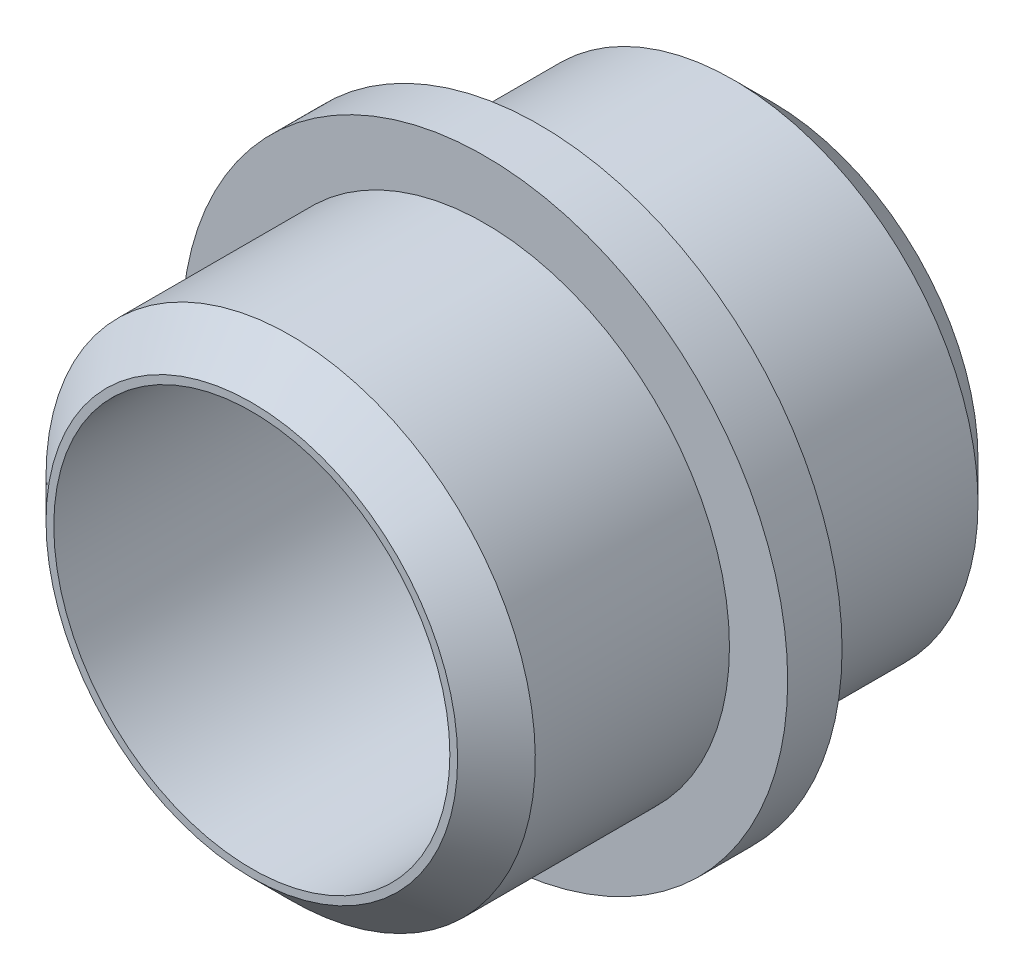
ISO-10303-21;
HEADER;
FILE_DESCRIPTION(('STEP AP214'),'2;1');
FILE_NAME('part.step','',(''),(''),'','','');
FILE_SCHEMA(('AUTOMOTIVE_DESIGN { 1 0 10303 214 1 1 1 1 }'));
ENDSEC;
DATA;
#1=APPLICATION_CONTEXT('core data for automotive mechanical design processes');
#2=APPLICATION_PROTOCOL_DEFINITION('international standard','automotive_design',2000,#1);
#3=PRODUCT_CONTEXT('',#1,'mechanical');
#4=PRODUCT('Part','Part','',(#3));
#5=PRODUCT_RELATED_PRODUCT_CATEGORY('part','',(#4));
#6=PRODUCT_DEFINITION_FORMATION('','',#4);
#7=PRODUCT_DEFINITION_CONTEXT('part definition',#1,'design');
#8=PRODUCT_DEFINITION('design','',#6,#7);
#9=PRODUCT_DEFINITION_SHAPE('','',#8);
#10=(LENGTH_UNIT() NAMED_UNIT(*) SI_UNIT(.MILLI.,.METRE.));
#11=(NAMED_UNIT(*) PLANE_ANGLE_UNIT() SI_UNIT($,.RADIAN.));
#12=(NAMED_UNIT(*) SI_UNIT($,.STERADIAN.) SOLID_ANGLE_UNIT());
#13=UNCERTAINTY_MEASURE_WITH_UNIT(LENGTH_MEASURE(1.E-05),#10,'distance_accuracy_value','');
#14=(GEOMETRIC_REPRESENTATION_CONTEXT(3) GLOBAL_UNCERTAINTY_ASSIGNED_CONTEXT((#13)) GLOBAL_UNIT_ASSIGNED_CONTEXT((#10,
#11,#12)) REPRESENTATION_CONTEXT('',''));
#15=CARTESIAN_POINT('',(0.,0.,0.));
#16=DIRECTION('',(0.,0.,1.));
#17=DIRECTION('',(1.,0.,0.));
#18=AXIS2_PLACEMENT_3D('',#15,#16,#17);
#19=CARTESIAN_POINT('',(9.,7.,43.1));
#20=DIRECTION('',(0.,0.,1.));
#21=DIRECTION('',(1.,0.,0.));
#22=AXIS2_PLACEMENT_3D('',#19,#20,#21);
#23=CYLINDRICAL_SURFACE('',#22,3.9);
#24=CARTESIAN_POINT('',(9.,7.,39.4));
#25=DIRECTION('',(0.,0.,1.));
#26=DIRECTION('',(1.,0.,0.));
#27=AXIS2_PLACEMENT_3D('',#24,#25,#26);
#28=CIRCLE('',#27,3.9);
#29=CARTESIAN_POINT('',(12.9,7.,39.4));
#30=VERTEX_POINT('',#29);
#31=EDGE_CURVE('E43',#30,#30,#28,.F.);
#32=ORIENTED_EDGE('',*,*,#31,.F.);
#33=EDGE_LOOP('',(#32));
#34=FACE_BOUND('',#33,.T.);
#35=CARTESIAN_POINT('',(9.,7.,40.1));
#36=DIRECTION('',(0.,0.,1.));
#37=DIRECTION('',(1.,0.,0.));
#38=AXIS2_PLACEMENT_3D('',#35,#36,#37);
#39=CIRCLE('',#38,3.9);
#40=CARTESIAN_POINT('',(12.9,7.,40.1));
#41=VERTEX_POINT('',#40);
#42=EDGE_CURVE('E17',#41,#41,#39,.T.);
#43=ORIENTED_EDGE('',*,*,#42,.F.);
#44=EDGE_LOOP('',(#43));
#45=FACE_BOUND('',#44,.T.);
#46=ADVANCED_FACE('F14',(#34,#45),#23,.T.);
#47=CARTESIAN_POINT('',(9.,7.,40.1));
#48=DIRECTION('',(0.,0.,1.));
#49=DIRECTION('',(1.,0.,0.));
#50=AXIS2_PLACEMENT_3D('',#47,#48,#49);
#51=PLANE('',#50);
#52=CARTESIAN_POINT('',(9.,7.,40.1));
#53=DIRECTION('',(0.,0.,-1.));
#54=DIRECTION('',(-1.,0.,0.));
#55=AXIS2_PLACEMENT_3D('',#52,#53,#54);
#56=CIRCLE('',#55,3.15);
#57=CARTESIAN_POINT('',(5.85,7.,40.1));
#58=VERTEX_POINT('',#57);
#59=EDGE_CURVE('E41',#58,#58,#56,.F.);
#60=ORIENTED_EDGE('',*,*,#59,.F.);
#61=EDGE_LOOP('',(#60));
#62=FACE_BOUND('',#61,.T.);
#63=ORIENTED_EDGE('',*,*,#42,.T.);
#64=EDGE_LOOP('',(#63));
#65=FACE_BOUND('',#64,.T.);
#66=ADVANCED_FACE('F50',(#62,#65),#51,.T.);
#67=CARTESIAN_POINT('',(9.,7.,39.4));
#68=DIRECTION('',(0.,0.,-1.));
#69=DIRECTION('',(-1.,0.,0.));
#70=AXIS2_PLACEMENT_3D('',#67,#68,#69);
#71=PLANE('',#70);
#72=CARTESIAN_POINT('',(9.,7.,39.4));
#73=DIRECTION('',(0.,0.,1.));
#74=DIRECTION('',(1.,0.,0.));
#75=AXIS2_PLACEMENT_3D('',#72,#73,#74);
#76=CIRCLE('',#75,3.15);
#77=CARTESIAN_POINT('',(12.15,7.,39.4));
#78=VERTEX_POINT('',#77);
#79=EDGE_CURVE('E38',#78,#78,#76,.F.);
#80=ORIENTED_EDGE('',*,*,#79,.F.);
#81=EDGE_LOOP('',(#80));
#82=FACE_BOUND('',#81,.T.);
#83=ORIENTED_EDGE('',*,*,#31,.T.);
#84=EDGE_LOOP('',(#83));
#85=FACE_BOUND('',#84,.T.);
#86=ADVANCED_FACE('F58',(#82,#85),#71,.T.);
#87=CARTESIAN_POINT('',(9.,7.,40.1));
#88=DIRECTION('',(0.,0.,-1.));
#89=DIRECTION('',(-1.,0.,0.));
#90=AXIS2_PLACEMENT_3D('',#87,#88,#89);
#91=CYLINDRICAL_SURFACE('',#90,3.15);
#92=ORIENTED_EDGE('',*,*,#59,.T.);
#93=EDGE_LOOP('',(#92));
#94=FACE_BOUND('',#93,.T.);
#95=CARTESIAN_POINT('',(9.,7.,42.5999999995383));
#96=DIRECTION('',(0.,0.,-1.));
#97=DIRECTION('',(-0.981575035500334,-0.191077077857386,0.));
#98=AXIS2_PLACEMENT_3D('',#95,#96,#97);
#99=CIRCLE('',#98,3.14999999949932);
#100=CARTESIAN_POINT('',(5.9080386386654,6.39810720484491,42.5999999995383));
#101=VERTEX_POINT('',#100);
#102=EDGE_CURVE('E29',#101,#101,#99,.F.);
#103=ORIENTED_EDGE('',*,*,#102,.F.);
#104=EDGE_LOOP('',(#103));
#105=FACE_BOUND('',#104,.T.);
#106=ADVANCED_FACE('F86',(#94,#105),#91,.T.);
#107=CARTESIAN_POINT('',(9.,7.,39.4));
#108=DIRECTION('',(0.,0.,1.));
#109=DIRECTION('',(1.,0.,0.));
#110=AXIS2_PLACEMENT_3D('',#107,#108,#109);
#111=CYLINDRICAL_SURFACE('',#110,3.15);
#112=CARTESIAN_POINT('',(9.,7.,36.9000000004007));
#113=DIRECTION('',(0.,0.,1.));
#114=DIRECTION('',(0.981575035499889,0.191077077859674,0.));
#115=AXIS2_PLACEMENT_3D('',#112,#113,#114);
#116=CIRCLE('',#115,3.14999999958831);
#117=CARTESIAN_POINT('',(12.0919613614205,7.60189279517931,36.9000000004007));
#118=VERTEX_POINT('',#117);
#119=EDGE_CURVE('E37',#118,#118,#116,.F.);
#120=ORIENTED_EDGE('',*,*,#119,.F.);
#121=EDGE_LOOP('',(#120));
#122=FACE_BOUND('',#121,.T.);
#123=ORIENTED_EDGE('',*,*,#79,.T.);
#124=EDGE_LOOP('',(#123));
#125=FACE_BOUND('',#124,.T.);
#126=ADVANCED_FACE('F82',(#122,#125),#111,.T.);
#127=CARTESIAN_POINT('',(9.,7.,42.5999999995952));
#128=DIRECTION('',(0.,0.,-1.));
#129=DIRECTION('',(-1.,0.,0.));
#130=AXIS2_PLACEMENT_3D('',#127,#128,#129);
#131=CONICAL_SURFACE('',#130,3.14999999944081,0.78539816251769);
#132=CARTESIAN_POINT('',(9.,7.,43.0999999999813));
#133=DIRECTION('',(0.,0.,-1.));
#134=DIRECTION('',(-1.,0.,0.));
#135=AXIS2_PLACEMENT_3D('',#132,#133,#134);
#136=CIRCLE('',#135,2.64999999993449);
#137=CARTESIAN_POINT('',(6.35000000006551,7.,43.0999999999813));
#138=VERTEX_POINT('',#137);
#139=EDGE_CURVE('E34',#138,#138,#136,.F.);
#140=ORIENTED_EDGE('',*,*,#139,.F.);
#141=EDGE_LOOP('',(#140));
#142=FACE_BOUND('',#141,.T.);
#143=ORIENTED_EDGE('',*,*,#102,.T.);
#144=EDGE_LOOP('',(#143));
#145=FACE_BOUND('',#144,.T.);
#146=ADVANCED_FACE('F78',(#142,#145),#131,.T.);
#147=CARTESIAN_POINT('',(9.,7.,36.900000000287));
#148=DIRECTION('',(0.,0.,1.));
#149=DIRECTION('',(1.,0.,0.));
#150=AXIS2_PLACEMENT_3D('',#147,#148,#149);
#151=CONICAL_SURFACE('',#150,3.14999999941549,0.785398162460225);
#152=ORIENTED_EDGE('',*,*,#119,.T.);
#153=EDGE_LOOP('',(#152));
#154=FACE_BOUND('',#153,.T.);
#155=CARTESIAN_POINT('',(9.,7.,36.3999999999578));
#156=DIRECTION('',(0.,0.,1.));
#157=DIRECTION('',(1.,0.,0.));
#158=AXIS2_PLACEMENT_3D('',#155,#156,#157);
#159=CIRCLE('',#158,2.65000000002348);
#160=CARTESIAN_POINT('',(11.6500000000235,7.,36.3999999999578));
#161=VERTEX_POINT('',#160);
#162=EDGE_CURVE('E26',#161,#161,#159,.T.);
#163=ORIENTED_EDGE('',*,*,#162,.T.);
#164=EDGE_LOOP('',(#163));
#165=FACE_BOUND('',#164,.T.);
#166=ADVANCED_FACE('F74',(#154,#165),#151,.T.);
#167=CARTESIAN_POINT('',(9.,7.,43.1));
#168=DIRECTION('',(0.,0.,1.));
#169=DIRECTION('',(1.,0.,0.));
#170=AXIS2_PLACEMENT_3D('',#167,#168,#169);
#171=PLANE('',#170);
#172=CARTESIAN_POINT('',(9.,7.,43.1));
#173=DIRECTION('',(0.,0.,1.));
#174=DIRECTION('',(1.,0.,0.));
#175=AXIS2_PLACEMENT_3D('',#172,#173,#174);
#176=CIRCLE('',#175,2.55);
#177=CARTESIAN_POINT('',(11.55,7.,43.1));
#178=VERTEX_POINT('',#177);
#179=EDGE_CURVE('E21',#178,#178,#176,.F.);
#180=ORIENTED_EDGE('',*,*,#179,.T.);
#181=EDGE_LOOP('',(#180));
#182=FACE_BOUND('',#181,.T.);
#183=ORIENTED_EDGE('',*,*,#139,.T.);
#184=EDGE_LOOP('',(#183));
#185=FACE_BOUND('',#184,.T.);
#186=ADVANCED_FACE('F68',(#182,#185),#171,.T.);
#187=CARTESIAN_POINT('',(9.,7.,36.4));
#188=DIRECTION('',(0.,0.,1.));
#189=DIRECTION('',(1.,0.,0.));
#190=AXIS2_PLACEMENT_3D('',#187,#188,#189);
#191=PLANE('',#190);
#192=CARTESIAN_POINT('',(9.,7.,36.4));
#193=DIRECTION('',(0.,0.,1.));
#194=DIRECTION('',(1.,0.,0.));
#195=AXIS2_PLACEMENT_3D('',#192,#193,#194);
#196=CIRCLE('',#195,2.55);
#197=CARTESIAN_POINT('',(11.55,7.,36.4));
#198=VERTEX_POINT('',#197);
#199=EDGE_CURVE('E9',#198,#198,#196,.T.);
#200=ORIENTED_EDGE('',*,*,#199,.T.);
#201=EDGE_LOOP('',(#200));
#202=FACE_BOUND('',#201,.T.);
#203=ORIENTED_EDGE('',*,*,#162,.F.);
#204=EDGE_LOOP('',(#203));
#205=FACE_BOUND('',#204,.T.);
#206=ADVANCED_FACE('F62',(#202,#205),#191,.F.);
#207=CARTESIAN_POINT('',(9.,7.,43.1));
#208=DIRECTION('',(0.,0.,1.));
#209=DIRECTION('',(1.,0.,0.));
#210=AXIS2_PLACEMENT_3D('',#207,#208,#209);
#211=CYLINDRICAL_SURFACE('',#210,2.55);
#212=ORIENTED_EDGE('',*,*,#199,.F.);
#213=EDGE_LOOP('',(#212));
#214=FACE_BOUND('',#213,.T.);
#215=ORIENTED_EDGE('',*,*,#179,.F.);
#216=EDGE_LOOP('',(#215));
#217=FACE_BOUND('',#216,.T.);
#218=ADVANCED_FACE('F60',(#214,#217),#211,.F.);
#219=CLOSED_SHELL('',(#46,#66,#86,#106,#126,#146,#166,#186,#206,#218));
#220=MANIFOLD_SOLID_BREP('B1',#219);
#221=ADVANCED_BREP_SHAPE_REPRESENTATION('',(#18,#220),#14);
#222=SHAPE_DEFINITION_REPRESENTATION(#9,#221);
ENDSEC;
END-ISO-10303-21;
